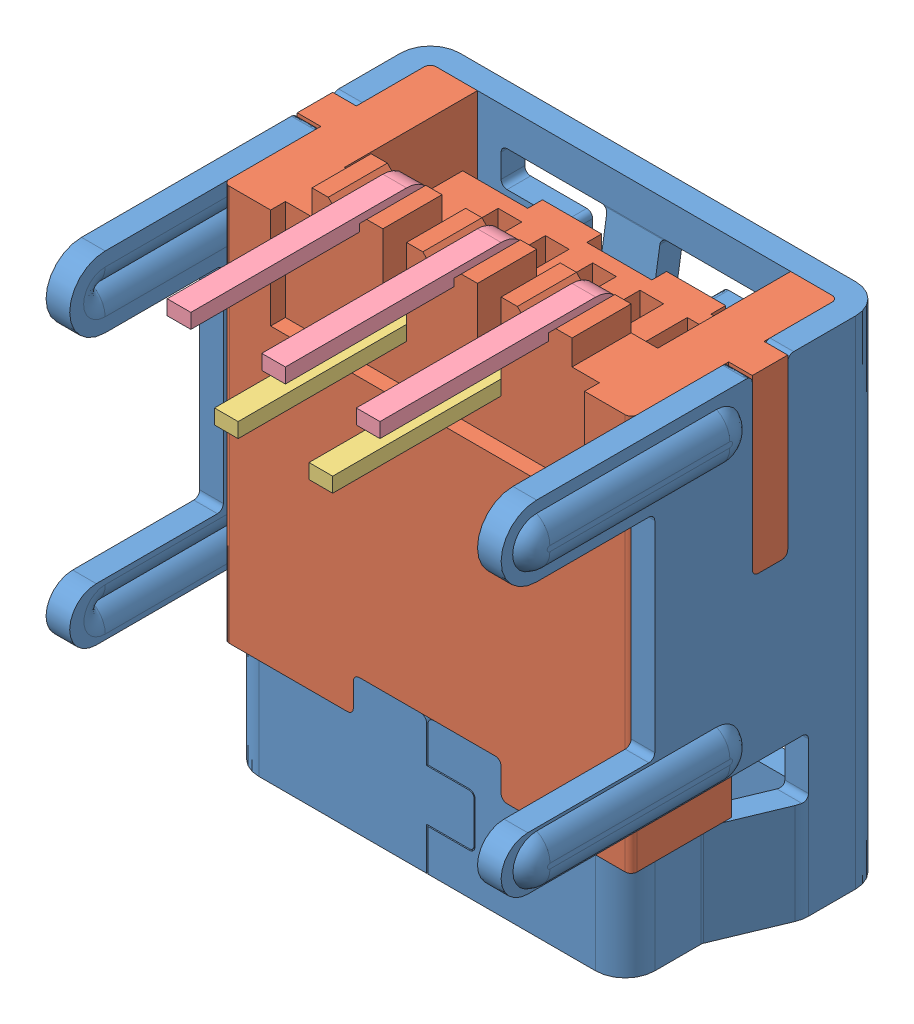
SolidWorks assembly APRS4624.sldasm, configuration Default (file format 5000). Lengths in mm.
Overall size (8.15 8.83 6.5).
7 component instances, 4 part files, 0 mates.
Components (placement in the parent):
- APRS4624_DEFAULT-4-1: APRS4624_DEFAULT-4.sldprt [Default] at origin size (8.15 8.4 6.5)
- APRS4624_DEFAULT-5-1: APRS4624_DEFAULT-5.sldprt [Default] at (0 2.725 0.2) size (7.7 7.93 3.5)
- APRS4624_DEFAULT-6-1: APRS4624_DEFAULT-6.sldprt [Default] at (-0.8 2.1125 0.575) size (0.41 6.73 5.5)
- APRS4624_DEFAULT-6-2: APRS4624_DEFAULT-6.sldprt [Default] at (0.8 2.1125 0.575) size (0.41 6.73 5.5)
- APRS4624_DEFAULT-7-1: APRS4624_DEFAULT-7.sldprt [Default] at (-1.6 2.7125 0.575) size (0.41 7.93 5.5)
- APRS4624_DEFAULT-7-2: APRS4624_DEFAULT-7.sldprt [Default] at (0 2.7125 0.575) size (0.41 7.93 5.5)
- APRS4624_DEFAULT-7-3: APRS4624_DEFAULT-7.sldprt [Default] at (1.6 2.7125 0.575) size (0.41 7.93 5.5)
